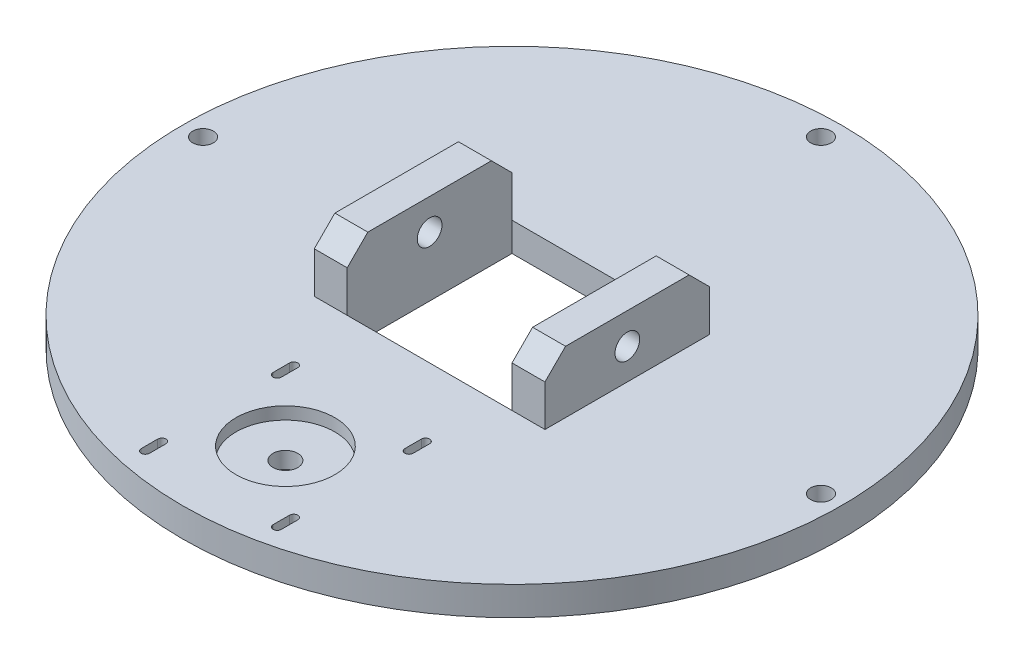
from build123d import *

# Parameters (mm, degrees)
SKETCH1_R               = 80
BOSS_EXTRUDE1_DEPTH     = 7
CUT_EXTRUDE1_REACH      = 115.353
SKETCH2_R               = 2.5
CUT_EXTRUDE2_REACH      = 115.353
SKETCH3_W               = 40
SKETCH3_H               = 40
SKETCH5_W               = 8
SKETCH5_H               = 40
BOSS_EXTRUDE2_DEPTH     = 15
FILLET1_SIZE            = 5
CUT_EXTRUDE4_REACH      = 138.191
SKETCH6_R               = 3
FILLET1_OF_MIRROR1_SIZE = 5
CUT_EXTRUDE3_REACH      = 116.127
SKETCH4_R               = 3
CUT_EXTRUDE5_START      = -2
CUT_EXTRUDE5_DEPTH      = 2
SKETCH8_R               = 12
CUT_EXTRUDE6_DEPTH      = 3


with BuildPart() as part:
    # Sketch1 → Boss-Extrude1 (new body)
    with BuildSketch(Plane(origin=(0, 0, 0), x_dir=(1, 0, 0), z_dir=(0, 1, 0))):
        with Locations(Location((0, 0, 0), (0, 0, 270))):
            Circle(SKETCH1_R)
    extrude(amount=BOSS_EXTRUDE1_DEPTH)

    # Sketch2 → Cut-Extrude1 (cut, up to next)
    with BuildSketch(Plane(origin=(0, 7, 0), x_dir=(1, 0, 0), z_dir=(0, 1, 0)), mode=Mode.PRIVATE) as cut_extrude1_sk1:
        with Locations(Location((-75, 0, 0), (0, 0, 270))):
            Circle(SKETCH2_R)
    cut_extrude1_tool1 = extrude(cut_extrude1_sk1.sketch, amount=-CUT_EXTRUDE1_REACH, mode=Mode.PRIVATE) & part.part
    # Sketch2 → Cut-Extrude1 (cut, up to next)
    with BuildSketch(Plane(origin=(0, 7, 0), x_dir=(1, 0, 0), z_dir=(0, 1, 0)), mode=Mode.PRIVATE) as cut_extrude1_sk2:
        with Locations(Location((0, 75, 0), (0, 0, 270))):
            Circle(SKETCH2_R)
    cut_extrude1_tool2 = extrude(cut_extrude1_sk2.sketch, amount=-CUT_EXTRUDE1_REACH, mode=Mode.PRIVATE) & part.part
    # Sketch2 → Cut-Extrude1 (cut, up to next)
    with BuildSketch(Plane(origin=(0, 7, 0), x_dir=(1, 0, 0), z_dir=(0, 1, 0)), mode=Mode.PRIVATE) as cut_extrude1_sk3:
        with Locations(Location((75, 0, 0), (0, 0, 270))):
            Circle(SKETCH2_R)
    cut_extrude1_tool3 = extrude(cut_extrude1_sk3.sketch, amount=-CUT_EXTRUDE1_REACH, mode=Mode.PRIVATE) & part.part
    add(cut_extrude1_tool1.solids().sort_by_distance((-75, 7, 0))[0], mode=Mode.SUBTRACT)
    add(cut_extrude1_tool2.solids().sort_by_distance((0, 7, -75))[0], mode=Mode.SUBTRACT)
    add(cut_extrude1_tool3.solids().sort_by_distance((75, 7, 0))[0], mode=Mode.SUBTRACT)

    # Sketch3 → Cut-Extrude2 (cut, up to next)
    with BuildSketch(Plane(origin=(0, 7, 0), x_dir=(1, 0, 0), z_dir=(0, 1, 0)), mode=Mode.PRIVATE) as cut_extrude2_sk1:
        Rectangle(SKETCH3_W, SKETCH3_H)
    cut_extrude2_tool1 = extrude(cut_extrude2_sk1.sketch, amount=-CUT_EXTRUDE2_REACH, mode=Mode.PRIVATE) & part.part
    add(cut_extrude2_tool1.solids().sort_by_distance((0, 7, 0))[0], mode=Mode.SUBTRACT)

    # Sketch5 → Boss-Extrude2 (add)
    with BuildSketch(Plane(origin=(0, 7, 0), x_dir=(1, 0, 0), z_dir=(0, 1, 0))):
        with Locations((-24, 0)):
            Rectangle(SKETCH5_W, SKETCH5_H)
    boss_extrude2 = extrude(amount=BOSS_EXTRUDE2_DEPTH)

    # Fillet1
    fillet1_edges = [part.edges().sort_by_distance(p)[0] for p in [
        (-24, 22, -20),
        (-24, 22, 20),
    ]]
    chamfer(fillet1_edges, length=FILLET1_SIZE)

    # Sketch6 → Cut-Extrude4 (cut, up to next)
    with BuildSketch(Plane.ZY.offset(28), mode=Mode.PRIVATE) as cut_extrude4_sk1:
        with Locations((0, 14.5)):
            Circle(SKETCH6_R)
    cut_extrude4_tool1 = extrude(cut_extrude4_sk1.sketch, amount=-CUT_EXTRUDE4_REACH, mode=Mode.PRIVATE) & part.part
    cut_extrude4 = cut_extrude4_tool1.solids().sort_by_distance((-28, 14.5, 0))[0]
    add(cut_extrude4, mode=Mode.SUBTRACT)

    # Mirror1: Boss-Extrude2, Cut-Extrude4 across plane
    add(boss_extrude2.mirror(Plane.ZY))
    add(cut_extrude4.mirror(Plane.ZY), mode=Mode.SUBTRACT)

    # Fillet1 of Mirror1
    fillet1_of_mirror1_edges = [part.edges().sort_by_distance(p)[0] for p in [
        (24, 22, -20),
        (24, 22, 20),
    ]]
    chamfer(fillet1_of_mirror1_edges, length=FILLET1_OF_MIRROR1_SIZE)

    # Sketch4 → Cut-Extrude3 (cut, up to next)
    with BuildSketch(Plane(origin=(0, 7, 0), x_dir=(1, 0, 0), z_dir=(0, 1, 0)), mode=Mode.PRIVATE) as cut_extrude3_sk1:
        with BuildLine():
            Line((-17, -37), (-17, -41))
            ThreePointArc((-17, -41), (-16, -42), (-15, -41))
            Line((-15, -41), (-15, -37))
            ThreePointArc((-15, -37), (-16, -36), (-17, -37))
        make_face()
    cut_extrude3_tool1 = extrude(cut_extrude3_sk1.sketch, amount=-CUT_EXTRUDE3_REACH, mode=Mode.PRIVATE) & part.part
    # Sketch4 → Cut-Extrude3 (cut, up to next)
    with BuildSketch(Plane(origin=(0, 7, 0), x_dir=(1, 0, 0), z_dir=(0, 1, 0)), mode=Mode.PRIVATE) as cut_extrude3_sk2:
        with BuildLine():
            Line((15, -37), (15, -41))
            ThreePointArc((15, -41), (16, -42), (17, -41))
            Line((17, -41), (17, -37))
            ThreePointArc((17, -37), (16, -36), (15, -37))
        make_face()
    cut_extrude3_tool2 = extrude(cut_extrude3_sk2.sketch, amount=-CUT_EXTRUDE3_REACH, mode=Mode.PRIVATE) & part.part
    # Sketch4 → Cut-Extrude3 (cut, up to next)
    with BuildSketch(Plane(origin=(0, 7, 0), x_dir=(1, 0, 0), z_dir=(0, 1, 0)), mode=Mode.PRIVATE) as cut_extrude3_sk3:
        with BuildLine():
            Line((15, -69), (15, -73))
            ThreePointArc((15, -73), (16, -74), (17, -73))
            Line((17, -73), (17, -69))
            ThreePointArc((17, -69), (16, -68), (15, -69))
        make_face()
    cut_extrude3_tool3 = extrude(cut_extrude3_sk3.sketch, amount=-CUT_EXTRUDE3_REACH, mode=Mode.PRIVATE) & part.part
    # Sketch4 → Cut-Extrude3 (cut, up to next)
    with BuildSketch(Plane(origin=(0, 7, 0), x_dir=(1, 0, 0), z_dir=(0, 1, 0)), mode=Mode.PRIVATE) as cut_extrude3_sk4:
        with BuildLine():
            Line((-17, -69), (-17, -73))
            ThreePointArc((-17, -73), (-16, -74), (-15, -73))
            Line((-15, -73), (-15, -69))
            ThreePointArc((-15, -69), (-16, -68), (-17, -69))
        make_face()
    cut_extrude3_tool4 = extrude(cut_extrude3_sk4.sketch, amount=-CUT_EXTRUDE3_REACH, mode=Mode.PRIVATE) & part.part
    # Sketch4 → Cut-Extrude3 (cut, up to next)
    with BuildSketch(Plane(origin=(0, 7, 0), x_dir=(1, 0, 0), z_dir=(0, 1, 0)), mode=Mode.PRIVATE) as cut_extrude3_sk5:
        with Locations(Location((0, -55, 0), (0, 0, 270))):
            Circle(SKETCH4_R)
    cut_extrude3_tool5 = extrude(cut_extrude3_sk5.sketch, amount=-CUT_EXTRUDE3_REACH, mode=Mode.PRIVATE) & part.part
    add(cut_extrude3_tool1.solids().sort_by_distance((-16, 7, 39))[0], mode=Mode.SUBTRACT)
    add(cut_extrude3_tool2.solids().sort_by_distance((16, 7, 39))[0], mode=Mode.SUBTRACT)
    add(cut_extrude3_tool3.solids().sort_by_distance((16, 7, 71))[0], mode=Mode.SUBTRACT)
    add(cut_extrude3_tool4.solids().sort_by_distance((-16, 7, 71))[0], mode=Mode.SUBTRACT)
    add(cut_extrude3_tool5.solids().sort_by_distance((0, 7, 55))[0], mode=Mode.SUBTRACT)

    # Sketch7 → Cut-Extrude5 (cut)
    # profile 1 of 4: a face of its own
    with BuildSketch(Plane.XZ.offset(CUT_EXTRUDE5_START)):
        with BuildLine():
            Line((-13.5, 69), (-13.5, 73))
            ThreePointArc((-13.5, 73), (-16, 75.5), (-18.5, 73))
            Line((-18.5, 73), (-18.5, 69))
            ThreePointArc((-18.5, 69), (-16, 66.5), (-13.5, 69))
        make_face()
        with BuildLine():
            ThreePointArc((-15, 69), (-16, 68), (-17, 69))
            Line((-17, 69), (-17, 73))
            ThreePointArc((-17, 73), (-16, 74), (-15, 73))
            Line((-15, 73), (-15, 69))
        make_face(mode=Mode.SUBTRACT)
    # profile 2 of 4: a face of its own
    with BuildSketch(Plane.XZ.offset(CUT_EXTRUDE5_START)):
        with BuildLine():
            Line((18.5, 69), (18.5, 73))
            ThreePointArc((18.5, 73), (16, 75.5), (13.5, 73))
            Line((13.5, 73), (13.5, 69))
            ThreePointArc((13.5, 69), (16, 66.5), (18.5, 69))
        make_face()
        with BuildLine():
            ThreePointArc((17, 69), (16, 68), (15, 69))
            Line((15, 69), (15, 73))
            ThreePointArc((15, 73), (16, 74), (17, 73))
            Line((17, 73), (17, 69))
        make_face(mode=Mode.SUBTRACT)
    # profile 3 of 4: a face of its own
    with BuildSketch(Plane.XZ.offset(CUT_EXTRUDE5_START)):
        with BuildLine():
            Line((-13.5, 37), (-13.5, 41))
            ThreePointArc((-13.5, 41), (-16, 43.5), (-18.5, 41))
            Line((-18.5, 41), (-18.5, 37))
            ThreePointArc((-18.5, 37), (-16, 34.5), (-13.5, 37))
        make_face()
        with BuildLine():
            ThreePointArc((-15, 37), (-16, 36), (-17, 37))
            Line((-17, 37), (-17, 41))
            ThreePointArc((-17, 41), (-16, 42), (-15, 41))
            Line((-15, 41), (-15, 37))
        make_face(mode=Mode.SUBTRACT)
    # profile 4 of 4: a face of its own
    with BuildSketch(Plane.XZ.offset(CUT_EXTRUDE5_START)):
        with BuildLine():
            Line((18.5, 37), (18.5, 41))
            ThreePointArc((18.5, 41), (16, 43.5), (13.5, 41))
            Line((13.5, 41), (13.5, 37))
            ThreePointArc((13.5, 37), (16, 34.5), (18.5, 37))
        make_face()
        with BuildLine():
            ThreePointArc((17, 37), (16, 36), (15, 37))
            Line((15, 37), (15, 41))
            ThreePointArc((15, 41), (16, 42), (17, 41))
            Line((17, 41), (17, 37))
        make_face(mode=Mode.SUBTRACT)
    extrude(amount=CUT_EXTRUDE5_DEPTH, mode=Mode.SUBTRACT)

    # Sketch8 → Cut-Extrude6 (cut)
    with BuildSketch(Plane(origin=(0, 7, 0), x_dir=(1, 0, 0), z_dir=(0, 1, 0))):
        with Locations(Location((0, -55, 0), (0, 0, 270))):
            Circle(SKETCH8_R)
    extrude(amount=-CUT_EXTRUDE6_DEPTH, mode=Mode.SUBTRACT)


solid = part.part
